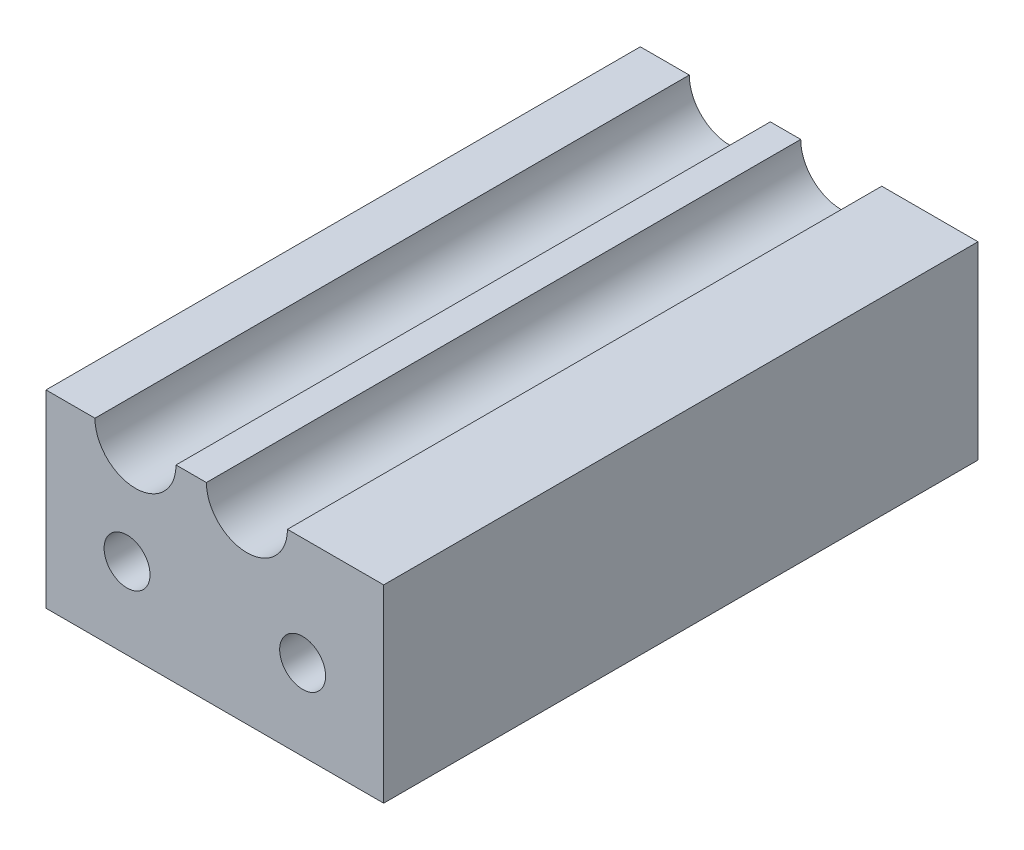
from build123d import *

# Parameters (mm, degrees)
BASE_EXTRUSION_DEPTH       = 88
TROU_TARAUD_M8X1_252_D     = 6.8
TROU_TARAUD_M8X1_252_DEPTH = 30
TROU_TARAUD_M8X1_252_TIP   = 2.042926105


with BuildPart() as part:
    # Esquisse1 → Base-Extrusion (new body)
    with BuildSketch(Plane.XY):
        with BuildLine():
            Line((-299, -176.5), (-249, -176.5))
            Line((-249, -176.5), (-249, -148.5))
            Line((-249, -148.5), (-263.25, -148.5))
            ThreePointArc((-263.25, -148.5), (-269.25, -154.5), (-275.25, -148.5))
            Line((-275.25, -148.5), (-279.75, -148.5))
            ThreePointArc((-279.75, -148.5), (-285.75, -154.5), (-291.75, -148.5))
            Line((-291.75, -148.5), (-299, -148.5))
            Line((-299, -148.5), (-299, -176.5))
        make_face()
    extrude(amount=-BASE_EXTRUSION_DEPTH)

    # Trou taraud_ M8x1.252
    with Locations(Plane.XY):
        with Locations((-261, -164.5), (-287, -164.5)):
            Hole(TROU_TARAUD_M8X1_252_D / 2, depth=TROU_TARAUD_M8X1_252_DEPTH)
            with Locations((0, 0, -(TROU_TARAUD_M8X1_252_DEPTH + TROU_TARAUD_M8X1_252_TIP / 2))):  # 118° drill point
                Cone(0, TROU_TARAUD_M8X1_252_D / 2, TROU_TARAUD_M8X1_252_TIP, mode=Mode.SUBTRACT)


solid = part.part
